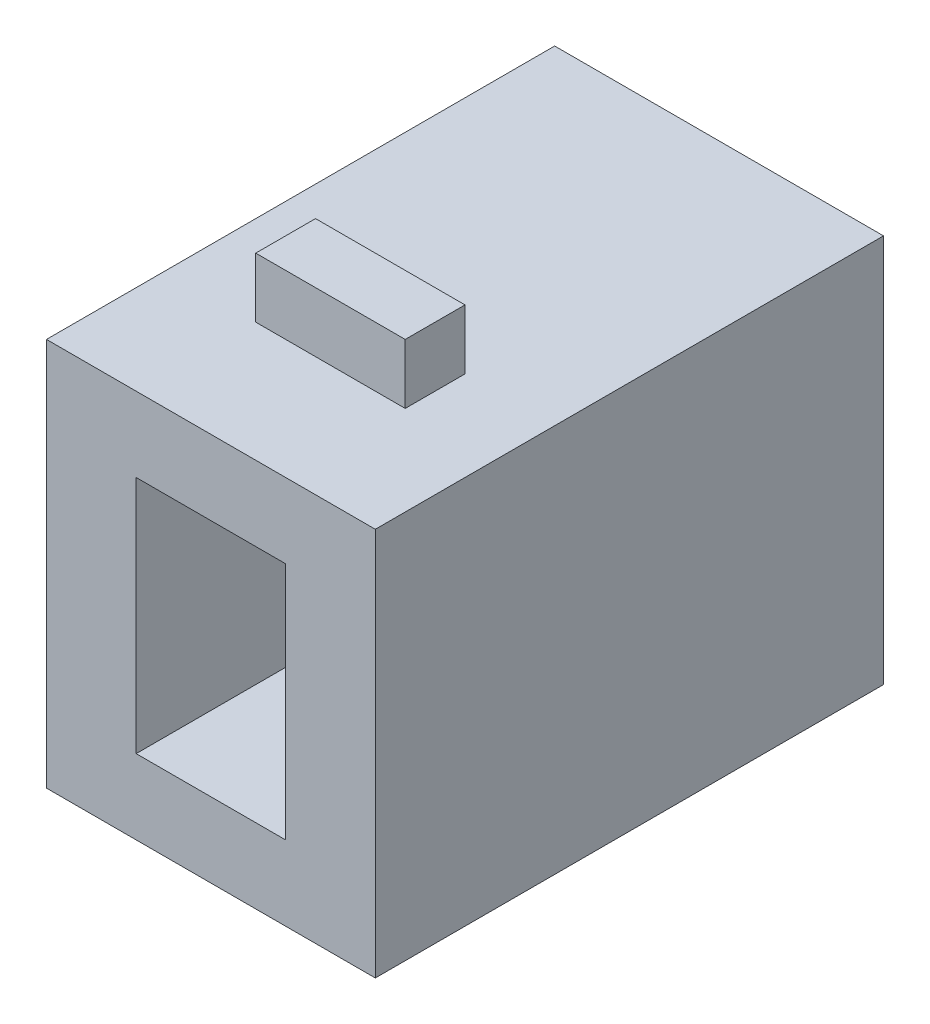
ISO-10303-21;
HEADER;
FILE_DESCRIPTION(('STEP AP214'),'2;1');
FILE_NAME('part.step','',(''),(''),'','','');
FILE_SCHEMA(('AUTOMOTIVE_DESIGN { 1 0 10303 214 1 1 1 1 }'));
ENDSEC;
DATA;
#1=APPLICATION_CONTEXT('core data for automotive mechanical design processes');
#2=APPLICATION_PROTOCOL_DEFINITION('international standard','automotive_design',2000,#1);
#3=PRODUCT_CONTEXT('',#1,'mechanical');
#4=PRODUCT('Part','Part','',(#3));
#5=PRODUCT_RELATED_PRODUCT_CATEGORY('part','',(#4));
#6=PRODUCT_DEFINITION_FORMATION('','',#4);
#7=PRODUCT_DEFINITION_CONTEXT('part definition',#1,'design');
#8=PRODUCT_DEFINITION('design','',#6,#7);
#9=PRODUCT_DEFINITION_SHAPE('','',#8);
#10=(LENGTH_UNIT() NAMED_UNIT(*) SI_UNIT(.MILLI.,.METRE.));
#11=(NAMED_UNIT(*) PLANE_ANGLE_UNIT() SI_UNIT($,.RADIAN.));
#12=(NAMED_UNIT(*) SI_UNIT($,.STERADIAN.) SOLID_ANGLE_UNIT());
#13=UNCERTAINTY_MEASURE_WITH_UNIT(LENGTH_MEASURE(1.E-05),#10,'distance_accuracy_value','');
#14=(GEOMETRIC_REPRESENTATION_CONTEXT(3) GLOBAL_UNCERTAINTY_ASSIGNED_CONTEXT((#13)) GLOBAL_UNIT_ASSIGNED_CONTEXT((#10,
#11,#12)) REPRESENTATION_CONTEXT('',''));
#15=CARTESIAN_POINT('',(0.,0.,0.));
#16=DIRECTION('',(0.,0.,1.));
#17=DIRECTION('',(1.,0.,0.));
#18=AXIS2_PLACEMENT_3D('',#15,#16,#17);
#19=CARTESIAN_POINT('',(-5.5,-6.49999999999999,15.));
#20=DIRECTION('',(0.,1.,0.));
#21=DIRECTION('',(0.,0.,1.));
#22=AXIS2_PLACEMENT_3D('',#19,#20,#21);
#23=PLANE('',#22);
#24=DIRECTION('',(0.,0.,-1.));
#25=VECTOR('',#24,1.);
#26=CARTESIAN_POINT('',(-5.5,-6.49999999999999,15.));
#27=LINE('',#26,#25);
#28=CARTESIAN_POINT('',(-5.5,-6.49999999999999,15.));
#29=VERTEX_POINT('',#28);
#30=CARTESIAN_POINT('',(-5.5,-6.50000000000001,-2.));
#31=VERTEX_POINT('',#30);
#32=EDGE_CURVE('E11',#29,#31,#27,.T.);
#33=ORIENTED_EDGE('',*,*,#32,.T.);
#34=DIRECTION('',(1.,0.,0.));
#35=VECTOR('',#34,1.);
#36=CARTESIAN_POINT('',(-5.5,-6.50000000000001,-2.));
#37=LINE('',#36,#35);
#38=CARTESIAN_POINT('',(5.5,-6.50000000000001,-2.));
#39=VERTEX_POINT('',#38);
#40=EDGE_CURVE('E239',#31,#39,#37,.T.);
#41=ORIENTED_EDGE('',*,*,#40,.T.);
#42=DIRECTION('',(0.,0.,-1.));
#43=VECTOR('',#42,1.);
#44=CARTESIAN_POINT('',(5.5,-6.49999999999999,15.));
#45=LINE('',#44,#43);
#46=CARTESIAN_POINT('',(5.5,-6.49999999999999,15.));
#47=VERTEX_POINT('',#46);
#48=EDGE_CURVE('E39',#47,#39,#45,.T.);
#49=ORIENTED_EDGE('',*,*,#48,.F.);
#50=DIRECTION('',(1.,0.,0.));
#51=VECTOR('',#50,1.);
#52=CARTESIAN_POINT('',(-5.5,-6.49999999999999,15.));
#53=LINE('',#52,#51);
#54=EDGE_CURVE('E251',#29,#47,#53,.T.);
#55=ORIENTED_EDGE('',*,*,#54,.F.);
#56=EDGE_LOOP('',(#33,#41,#49,#55));
#57=FACE_BOUND('',#56,.T.);
#58=DIRECTION('',(0.,0.,1.));
#59=VECTOR('',#58,1.);
#60=CARTESIAN_POINT('',(2.5,-6.49999999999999,11.));
#61=LINE('',#60,#59);
#62=CARTESIAN_POINT('',(2.5,-6.49999999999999,8.99999999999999));
#63=VERTEX_POINT('',#62);
#64=CARTESIAN_POINT('',(2.5,-6.49999999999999,11.));
#65=VERTEX_POINT('',#64);
#66=EDGE_CURVE('E139',#63,#65,#61,.T.);
#67=ORIENTED_EDGE('',*,*,#66,.F.);
#68=DIRECTION('',(1.,0.,0.));
#69=VECTOR('',#68,1.);
#70=CARTESIAN_POINT('',(2.5,-6.49999999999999,8.99999999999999));
#71=LINE('',#70,#69);
#72=CARTESIAN_POINT('',(-2.5,-6.49999999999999,9.));
#73=VERTEX_POINT('',#72);
#74=EDGE_CURVE('E141',#73,#63,#71,.T.);
#75=ORIENTED_EDGE('',*,*,#74,.F.);
#76=DIRECTION('',(0.,0.,-1.));
#77=VECTOR('',#76,1.);
#78=CARTESIAN_POINT('',(-2.5,-6.49999999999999,11.));
#79=LINE('',#78,#77);
#80=CARTESIAN_POINT('',(-2.5,-6.49999999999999,11.));
#81=VERTEX_POINT('',#80);
#82=EDGE_CURVE('E51',#81,#73,#79,.T.);
#83=ORIENTED_EDGE('',*,*,#82,.F.);
#84=DIRECTION('',(-1.,0.,0.));
#85=VECTOR('',#84,1.);
#86=CARTESIAN_POINT('',(2.5,-6.49999999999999,11.));
#87=LINE('',#86,#85);
#88=EDGE_CURVE('E46',#65,#81,#87,.T.);
#89=ORIENTED_EDGE('',*,*,#88,.F.);
#90=EDGE_LOOP('',(#67,#75,#83,#89));
#91=FACE_BOUND('',#90,.T.);
#92=ADVANCED_FACE('F31',(#57,#91),#23,.F.);
#93=CARTESIAN_POINT('',(-5.5,6.50000000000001,15.));
#94=DIRECTION('',(0.,-1.,0.));
#95=DIRECTION('',(0.,0.,-1.));
#96=AXIS2_PLACEMENT_3D('',#93,#94,#95);
#97=PLANE('',#96);
#98=DIRECTION('',(0.,0.,-1.));
#99=VECTOR('',#98,1.);
#100=CARTESIAN_POINT('',(5.5,6.50000000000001,15.));
#101=LINE('',#100,#99);
#102=CARTESIAN_POINT('',(5.5,6.50000000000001,15.));
#103=VERTEX_POINT('',#102);
#104=CARTESIAN_POINT('',(5.5,6.50000000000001,-2.));
#105=VERTEX_POINT('',#104);
#106=EDGE_CURVE('E259',#103,#105,#101,.T.);
#107=ORIENTED_EDGE('',*,*,#106,.T.);
#108=DIRECTION('',(-1.,0.,0.));
#109=VECTOR('',#108,1.);
#110=CARTESIAN_POINT('',(-5.5,6.50000000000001,-2.));
#111=LINE('',#110,#109);
#112=CARTESIAN_POINT('',(-5.5,6.50000000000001,-2.));
#113=VERTEX_POINT('',#112);
#114=EDGE_CURVE('E245',#105,#113,#111,.T.);
#115=ORIENTED_EDGE('',*,*,#114,.T.);
#116=DIRECTION('',(0.,0.,-1.));
#117=VECTOR('',#116,1.);
#118=CARTESIAN_POINT('',(-5.5,6.50000000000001,15.));
#119=LINE('',#118,#117);
#120=CARTESIAN_POINT('',(-5.5,6.50000000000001,15.));
#121=VERTEX_POINT('',#120);
#122=EDGE_CURVE('E257',#121,#113,#119,.T.);
#123=ORIENTED_EDGE('',*,*,#122,.F.);
#124=DIRECTION('',(-1.,0.,0.));
#125=VECTOR('',#124,1.);
#126=CARTESIAN_POINT('',(-5.5,6.50000000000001,15.));
#127=LINE('',#126,#125);
#128=EDGE_CURVE('E255',#103,#121,#127,.T.);
#129=ORIENTED_EDGE('',*,*,#128,.F.);
#130=EDGE_LOOP('',(#107,#115,#123,#129));
#131=FACE_BOUND('',#130,.T.);
#132=DIRECTION('',(0.,0.,-1.));
#133=VECTOR('',#132,1.);
#134=CARTESIAN_POINT('',(2.5,6.50000000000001,9.));
#135=LINE('',#134,#133);
#136=CARTESIAN_POINT('',(2.5,6.50000000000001,11.));
#137=VERTEX_POINT('',#136);
#138=CARTESIAN_POINT('',(2.5,6.50000000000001,9.));
#139=VERTEX_POINT('',#138);
#140=EDGE_CURVE('E171',#137,#139,#135,.T.);
#141=ORIENTED_EDGE('',*,*,#140,.F.);
#142=DIRECTION('',(1.,0.,0.));
#143=VECTOR('',#142,1.);
#144=CARTESIAN_POINT('',(2.5,6.50000000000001,11.));
#145=LINE('',#144,#143);
#146=CARTESIAN_POINT('',(-2.5,6.50000000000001,11.));
#147=VERTEX_POINT('',#146);
#148=EDGE_CURVE('E180',#147,#137,#145,.T.);
#149=ORIENTED_EDGE('',*,*,#148,.F.);
#150=DIRECTION('',(0.,0.,1.));
#151=VECTOR('',#150,1.);
#152=CARTESIAN_POINT('',(-2.5,6.50000000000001,9.));
#153=LINE('',#152,#151);
#154=CARTESIAN_POINT('',(-2.5,6.50000000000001,9.));
#155=VERTEX_POINT('',#154);
#156=EDGE_CURVE('E177',#155,#147,#153,.T.);
#157=ORIENTED_EDGE('',*,*,#156,.F.);
#158=DIRECTION('',(-1.,0.,0.));
#159=VECTOR('',#158,1.);
#160=CARTESIAN_POINT('',(2.5,6.50000000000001,9.));
#161=LINE('',#160,#159);
#162=EDGE_CURVE('E174',#139,#155,#161,.T.);
#163=ORIENTED_EDGE('',*,*,#162,.F.);
#164=EDGE_LOOP('',(#141,#149,#157,#163));
#165=FACE_BOUND('',#164,.T.);
#166=ADVANCED_FACE('F277',(#131,#165),#97,.F.);
#167=CARTESIAN_POINT('',(-5.5,-6.49999999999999,15.));
#168=DIRECTION('',(1.,0.,0.));
#169=DIRECTION('',(0.,0.,-1.));
#170=AXIS2_PLACEMENT_3D('',#167,#168,#169);
#171=PLANE('',#170);
#172=ORIENTED_EDGE('',*,*,#122,.T.);
#173=DIRECTION('',(0.,-1.,0.));
#174=VECTOR('',#173,1.);
#175=CARTESIAN_POINT('',(-5.5,-6.50000000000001,-2.));
#176=LINE('',#175,#174);
#177=EDGE_CURVE('E230',#113,#31,#176,.T.);
#178=ORIENTED_EDGE('',*,*,#177,.T.);
#179=ORIENTED_EDGE('',*,*,#32,.F.);
#180=DIRECTION('',(0.,-1.,0.));
#181=VECTOR('',#180,1.);
#182=CARTESIAN_POINT('',(-5.5,-6.49999999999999,15.));
#183=LINE('',#182,#181);
#184=EDGE_CURVE('E248',#121,#29,#183,.T.);
#185=ORIENTED_EDGE('',*,*,#184,.F.);
#186=EDGE_LOOP('',(#172,#178,#179,#185));
#187=FACE_BOUND('',#186,.T.);
#188=ADVANCED_FACE('F33',(#187),#171,.F.);
#189=CARTESIAN_POINT('',(5.5,-6.49999999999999,15.));
#190=DIRECTION('',(-1.,0.,0.));
#191=DIRECTION('',(0.,0.,1.));
#192=AXIS2_PLACEMENT_3D('',#189,#190,#191);
#193=PLANE('',#192);
#194=ORIENTED_EDGE('',*,*,#48,.T.);
#195=DIRECTION('',(0.,1.,0.));
#196=VECTOR('',#195,1.);
#197=CARTESIAN_POINT('',(5.5,-6.50000000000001,-2.));
#198=LINE('',#197,#196);
#199=EDGE_CURVE('E242',#39,#105,#198,.T.);
#200=ORIENTED_EDGE('',*,*,#199,.T.);
#201=ORIENTED_EDGE('',*,*,#106,.F.);
#202=DIRECTION('',(0.,1.,0.));
#203=VECTOR('',#202,1.);
#204=CARTESIAN_POINT('',(5.5,-6.49999999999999,15.));
#205=LINE('',#204,#203);
#206=EDGE_CURVE('E253',#47,#103,#205,.T.);
#207=ORIENTED_EDGE('',*,*,#206,.F.);
#208=EDGE_LOOP('',(#194,#200,#201,#207));
#209=FACE_BOUND('',#208,.T.);
#210=ADVANCED_FACE('F264',(#209),#193,.F.);
#211=CARTESIAN_POINT('',(-5.5,6.50000000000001,15.));
#212=DIRECTION('',(0.,0.,-1.));
#213=DIRECTION('',(-1.,0.,0.));
#214=AXIS2_PLACEMENT_3D('',#211,#212,#213);
#215=PLANE('',#214);
#216=DIRECTION('',(1.,0.,0.));
#217=VECTOR('',#216,1.);
#218=CARTESIAN_POINT('',(-2.5,-3.99999999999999,15.));
#219=LINE('',#218,#217);
#220=CARTESIAN_POINT('',(-2.5,-3.99999999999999,15.));
#221=VERTEX_POINT('',#220);
#222=CARTESIAN_POINT('',(2.5,-3.99999999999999,15.));
#223=VERTEX_POINT('',#222);
#224=EDGE_CURVE('E206',#221,#223,#219,.T.);
#225=ORIENTED_EDGE('',*,*,#224,.F.);
#226=DIRECTION('',(0.,-1.,0.));
#227=VECTOR('',#226,1.);
#228=CARTESIAN_POINT('',(-2.5,4.,15.));
#229=LINE('',#228,#227);
#230=CARTESIAN_POINT('',(-2.5,4.,15.));
#231=VERTEX_POINT('',#230);
#232=EDGE_CURVE('E204',#231,#221,#229,.T.);
#233=ORIENTED_EDGE('',*,*,#232,.F.);
#234=DIRECTION('',(-1.,0.,0.));
#235=VECTOR('',#234,1.);
#236=CARTESIAN_POINT('',(-2.5,4.,15.));
#237=LINE('',#236,#235);
#238=CARTESIAN_POINT('',(2.5,4.,15.));
#239=VERTEX_POINT('',#238);
#240=EDGE_CURVE('E212',#239,#231,#237,.T.);
#241=ORIENTED_EDGE('',*,*,#240,.F.);
#242=DIRECTION('',(0.,1.,0.));
#243=VECTOR('',#242,1.);
#244=CARTESIAN_POINT('',(2.5,4.,15.));
#245=LINE('',#244,#243);
#246=EDGE_CURVE('E209',#223,#239,#245,.T.);
#247=ORIENTED_EDGE('',*,*,#246,.F.);
#248=EDGE_LOOP('',(#225,#233,#241,#247));
#249=FACE_BOUND('',#248,.T.);
#250=ORIENTED_EDGE('',*,*,#184,.T.);
#251=ORIENTED_EDGE('',*,*,#54,.T.);
#252=ORIENTED_EDGE('',*,*,#206,.T.);
#253=ORIENTED_EDGE('',*,*,#128,.T.);
#254=EDGE_LOOP('',(#250,#251,#252,#253));
#255=FACE_BOUND('',#254,.T.);
#256=ADVANCED_FACE('F281',(#249,#255),#215,.F.);
#257=CARTESIAN_POINT('',(-5.5,6.50000000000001,-2.));
#258=DIRECTION('',(0.,0.,-1.));
#259=DIRECTION('',(-1.,0.,0.));
#260=AXIS2_PLACEMENT_3D('',#257,#258,#259);
#261=PLANE('',#260);
#262=ORIENTED_EDGE('',*,*,#177,.F.);
#263=ORIENTED_EDGE('',*,*,#114,.F.);
#264=ORIENTED_EDGE('',*,*,#199,.F.);
#265=ORIENTED_EDGE('',*,*,#40,.F.);
#266=EDGE_LOOP('',(#262,#263,#264,#265));
#267=FACE_BOUND('',#266,.T.);
#268=ADVANCED_FACE('F271',(#267),#261,.T.);
#269=CARTESIAN_POINT('',(-2.5,4.,0.));
#270=DIRECTION('',(-1.,0.,0.));
#271=DIRECTION('',(0.,0.,1.));
#272=AXIS2_PLACEMENT_3D('',#269,#270,#271);
#273=PLANE('',#272);
#274=ORIENTED_EDGE('',*,*,#232,.T.);
#275=DIRECTION('',(0.,0.,1.));
#276=VECTOR('',#275,1.);
#277=CARTESIAN_POINT('',(-2.5,-4.,0.));
#278=LINE('',#277,#276);
#279=CARTESIAN_POINT('',(-2.5,-4.,0.));
#280=VERTEX_POINT('',#279);
#281=EDGE_CURVE('E227',#280,#221,#278,.T.);
#282=ORIENTED_EDGE('',*,*,#281,.F.);
#283=DIRECTION('',(0.,-1.,0.));
#284=VECTOR('',#283,1.);
#285=CARTESIAN_POINT('',(-2.5,4.,0.));
#286=LINE('',#285,#284);
#287=CARTESIAN_POINT('',(-2.5,4.,0.));
#288=VERTEX_POINT('',#287);
#289=EDGE_CURVE('E215',#288,#280,#286,.T.);
#290=ORIENTED_EDGE('',*,*,#289,.F.);
#291=DIRECTION('',(0.,0.,1.));
#292=VECTOR('',#291,1.);
#293=CARTESIAN_POINT('',(-2.5,4.,0.));
#294=LINE('',#293,#292);
#295=EDGE_CURVE('E228',#288,#231,#294,.T.);
#296=ORIENTED_EDGE('',*,*,#295,.T.);
#297=EDGE_LOOP('',(#274,#282,#290,#296));
#298=FACE_BOUND('',#297,.T.);
#299=ADVANCED_FACE('F289',(#298),#273,.F.);
#300=CARTESIAN_POINT('',(-2.5,4.,0.));
#301=DIRECTION('',(0.,1.,0.));
#302=DIRECTION('',(0.,0.,1.));
#303=AXIS2_PLACEMENT_3D('',#300,#301,#302);
#304=PLANE('',#303);
#305=ORIENTED_EDGE('',*,*,#240,.T.);
#306=ORIENTED_EDGE('',*,*,#295,.F.);
#307=DIRECTION('',(-1.,0.,0.));
#308=VECTOR('',#307,1.);
#309=CARTESIAN_POINT('',(-2.5,4.,0.));
#310=LINE('',#309,#308);
#311=CARTESIAN_POINT('',(2.5,4.,0.));
#312=VERTEX_POINT('',#311);
#313=EDGE_CURVE('E224',#312,#288,#310,.T.);
#314=ORIENTED_EDGE('',*,*,#313,.F.);
#315=DIRECTION('',(0.,0.,1.));
#316=VECTOR('',#315,1.);
#317=CARTESIAN_POINT('',(2.5,4.,0.));
#318=LINE('',#317,#316);
#319=EDGE_CURVE('E231',#312,#239,#318,.T.);
#320=ORIENTED_EDGE('',*,*,#319,.T.);
#321=EDGE_LOOP('',(#305,#306,#314,#320));
#322=FACE_BOUND('',#321,.T.);
#323=ADVANCED_FACE('F326',(#322),#304,.F.);
#324=CARTESIAN_POINT('',(2.5,4.,0.));
#325=DIRECTION('',(1.,0.,0.));
#326=DIRECTION('',(0.,1.,0.));
#327=AXIS2_PLACEMENT_3D('',#324,#325,#326);
#328=PLANE('',#327);
#329=ORIENTED_EDGE('',*,*,#246,.T.);
#330=ORIENTED_EDGE('',*,*,#319,.F.);
#331=DIRECTION('',(0.,1.,0.));
#332=VECTOR('',#331,1.);
#333=CARTESIAN_POINT('',(2.5,4.,0.));
#334=LINE('',#333,#332);
#335=CARTESIAN_POINT('',(2.5,-4.,0.));
#336=VERTEX_POINT('',#335);
#337=EDGE_CURVE('E221',#336,#312,#334,.T.);
#338=ORIENTED_EDGE('',*,*,#337,.F.);
#339=DIRECTION('',(0.,0.,1.));
#340=VECTOR('',#339,1.);
#341=CARTESIAN_POINT('',(2.5,-4.,0.));
#342=LINE('',#341,#340);
#343=EDGE_CURVE('E233',#336,#223,#342,.T.);
#344=ORIENTED_EDGE('',*,*,#343,.T.);
#345=EDGE_LOOP('',(#329,#330,#338,#344));
#346=FACE_BOUND('',#345,.T.);
#347=ADVANCED_FACE('F336',(#346),#328,.F.);
#348=CARTESIAN_POINT('',(-2.5,-4.,0.));
#349=DIRECTION('',(0.,-1.,0.));
#350=DIRECTION('',(0.,0.,-1.));
#351=AXIS2_PLACEMENT_3D('',#348,#349,#350);
#352=PLANE('',#351);
#353=ORIENTED_EDGE('',*,*,#224,.T.);
#354=ORIENTED_EDGE('',*,*,#343,.F.);
#355=DIRECTION('',(1.,0.,0.));
#356=VECTOR('',#355,1.);
#357=CARTESIAN_POINT('',(-2.5,-4.,0.));
#358=LINE('',#357,#356);
#359=EDGE_CURVE('E218',#280,#336,#358,.T.);
#360=ORIENTED_EDGE('',*,*,#359,.F.);
#361=ORIENTED_EDGE('',*,*,#281,.T.);
#362=EDGE_LOOP('',(#353,#354,#360,#361));
#363=FACE_BOUND('',#362,.T.);
#364=ADVANCED_FACE('F346',(#363),#352,.F.);
#365=CARTESIAN_POINT('',(-2.5,-4.,0.));
#366=DIRECTION('',(0.,0.,1.));
#367=DIRECTION('',(1.,0.,0.));
#368=AXIS2_PLACEMENT_3D('',#365,#366,#367);
#369=PLANE('',#368);
#370=ORIENTED_EDGE('',*,*,#289,.T.);
#371=ORIENTED_EDGE('',*,*,#359,.T.);
#372=ORIENTED_EDGE('',*,*,#337,.T.);
#373=ORIENTED_EDGE('',*,*,#313,.T.);
#374=EDGE_LOOP('',(#370,#371,#372,#373));
#375=FACE_BOUND('',#374,.T.);
#376=ADVANCED_FACE('F356',(#375),#369,.T.);
#377=CARTESIAN_POINT('',(2.5,8.50000000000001,9.));
#378=DIRECTION('',(-1.,0.,0.));
#379=DIRECTION('',(0.,0.,1.));
#380=AXIS2_PLACEMENT_3D('',#377,#378,#379);
#381=PLANE('',#380);
#382=ORIENTED_EDGE('',*,*,#140,.T.);
#383=DIRECTION('',(0.,-1.,0.));
#384=VECTOR('',#383,1.);
#385=CARTESIAN_POINT('',(2.5,8.50000000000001,9.));
#386=LINE('',#385,#384);
#387=CARTESIAN_POINT('',(2.5,8.50000000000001,9.));
#388=VERTEX_POINT('',#387);
#389=EDGE_CURVE('E201',#388,#139,#386,.T.);
#390=ORIENTED_EDGE('',*,*,#389,.F.);
#391=DIRECTION('',(0.,0.,-1.));
#392=VECTOR('',#391,1.);
#393=CARTESIAN_POINT('',(2.5,8.50000000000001,9.));
#394=LINE('',#393,#392);
#395=CARTESIAN_POINT('',(2.5,8.50000000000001,11.));
#396=VERTEX_POINT('',#395);
#397=EDGE_CURVE('E183',#396,#388,#394,.T.);
#398=ORIENTED_EDGE('',*,*,#397,.F.);
#399=DIRECTION('',(0.,-1.,0.));
#400=VECTOR('',#399,1.);
#401=CARTESIAN_POINT('',(2.5,8.50000000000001,11.));
#402=LINE('',#401,#400);
#403=EDGE_CURVE('E192',#396,#137,#402,.T.);
#404=ORIENTED_EDGE('',*,*,#403,.T.);
#405=EDGE_LOOP('',(#382,#390,#398,#404));
#406=FACE_BOUND('',#405,.T.);
#407=ADVANCED_FACE('F366',(#406),#381,.F.);
#408=CARTESIAN_POINT('',(2.5,8.50000000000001,9.));
#409=DIRECTION('',(0.,0.,1.));
#410=DIRECTION('',(1.,0.,0.));
#411=AXIS2_PLACEMENT_3D('',#408,#409,#410);
#412=PLANE('',#411);
#413=ORIENTED_EDGE('',*,*,#162,.T.);
#414=DIRECTION('',(0.,-1.,0.));
#415=VECTOR('',#414,1.);
#416=CARTESIAN_POINT('',(-2.5,8.50000000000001,9.));
#417=LINE('',#416,#415);
#418=CARTESIAN_POINT('',(-2.5,8.50000000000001,9.));
#419=VERTEX_POINT('',#418);
#420=EDGE_CURVE('E198',#419,#155,#417,.T.);
#421=ORIENTED_EDGE('',*,*,#420,.F.);
#422=DIRECTION('',(-1.,0.,0.));
#423=VECTOR('',#422,1.);
#424=CARTESIAN_POINT('',(2.5,8.50000000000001,9.));
#425=LINE('',#424,#423);
#426=EDGE_CURVE('E186',#388,#419,#425,.T.);
#427=ORIENTED_EDGE('',*,*,#426,.F.);
#428=ORIENTED_EDGE('',*,*,#389,.T.);
#429=EDGE_LOOP('',(#413,#421,#427,#428));
#430=FACE_BOUND('',#429,.T.);
#431=ADVANCED_FACE('F377',(#430),#412,.F.);
#432=CARTESIAN_POINT('',(-2.5,8.50000000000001,9.));
#433=DIRECTION('',(1.,0.,0.));
#434=DIRECTION('',(0.,0.,-1.));
#435=AXIS2_PLACEMENT_3D('',#432,#433,#434);
#436=PLANE('',#435);
#437=ORIENTED_EDGE('',*,*,#156,.T.);
#438=DIRECTION('',(0.,-1.,0.));
#439=VECTOR('',#438,1.);
#440=CARTESIAN_POINT('',(-2.5,8.50000000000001,11.));
#441=LINE('',#440,#439);
#442=CARTESIAN_POINT('',(-2.5,8.50000000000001,11.));
#443=VERTEX_POINT('',#442);
#444=EDGE_CURVE('E195',#443,#147,#441,.T.);
#445=ORIENTED_EDGE('',*,*,#444,.F.);
#446=DIRECTION('',(0.,0.,1.));
#447=VECTOR('',#446,1.);
#448=CARTESIAN_POINT('',(-2.5,8.50000000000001,9.));
#449=LINE('',#448,#447);
#450=EDGE_CURVE('E188',#419,#443,#449,.T.);
#451=ORIENTED_EDGE('',*,*,#450,.F.);
#452=ORIENTED_EDGE('',*,*,#420,.T.);
#453=EDGE_LOOP('',(#437,#445,#451,#452));
#454=FACE_BOUND('',#453,.T.);
#455=ADVANCED_FACE('F387',(#454),#436,.F.);
#456=CARTESIAN_POINT('',(2.5,8.50000000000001,11.));
#457=DIRECTION('',(0.,0.,-1.));
#458=DIRECTION('',(-1.,0.,0.));
#459=AXIS2_PLACEMENT_3D('',#456,#457,#458);
#460=PLANE('',#459);
#461=ORIENTED_EDGE('',*,*,#148,.T.);
#462=ORIENTED_EDGE('',*,*,#403,.F.);
#463=DIRECTION('',(1.,0.,0.));
#464=VECTOR('',#463,1.);
#465=CARTESIAN_POINT('',(2.5,8.50000000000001,11.));
#466=LINE('',#465,#464);
#467=EDGE_CURVE('E190',#443,#396,#466,.T.);
#468=ORIENTED_EDGE('',*,*,#467,.F.);
#469=ORIENTED_EDGE('',*,*,#444,.T.);
#470=EDGE_LOOP('',(#461,#462,#468,#469));
#471=FACE_BOUND('',#470,.T.);
#472=ADVANCED_FACE('F397',(#471),#460,.F.);
#473=CARTESIAN_POINT('',(2.5,8.50000000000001,11.));
#474=DIRECTION('',(0.,-1.,0.));
#475=DIRECTION('',(0.,0.,-1.));
#476=AXIS2_PLACEMENT_3D('',#473,#474,#475);
#477=PLANE('',#476);
#478=ORIENTED_EDGE('',*,*,#397,.T.);
#479=ORIENTED_EDGE('',*,*,#426,.T.);
#480=ORIENTED_EDGE('',*,*,#450,.T.);
#481=ORIENTED_EDGE('',*,*,#467,.T.);
#482=EDGE_LOOP('',(#478,#479,#480,#481));
#483=FACE_BOUND('',#482,.T.);
#484=ADVANCED_FACE('F407',(#483),#477,.F.);
#485=CARTESIAN_POINT('',(2.5,-8.49999999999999,11.));
#486=DIRECTION('',(-1.,0.,0.));
#487=DIRECTION('',(0.,0.,1.));
#488=AXIS2_PLACEMENT_3D('',#485,#486,#487);
#489=PLANE('',#488);
#490=ORIENTED_EDGE('',*,*,#66,.T.);
#491=DIRECTION('',(0.,1.,0.));
#492=VECTOR('',#491,1.);
#493=CARTESIAN_POINT('',(2.5,-8.49999999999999,11.));
#494=LINE('',#493,#492);
#495=CARTESIAN_POINT('',(2.5,-8.49999999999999,11.));
#496=VERTEX_POINT('',#495);
#497=EDGE_CURVE('E169',#496,#65,#494,.T.);
#498=ORIENTED_EDGE('',*,*,#497,.F.);
#499=DIRECTION('',(0.,0.,1.));
#500=VECTOR('',#499,1.);
#501=CARTESIAN_POINT('',(2.5,-8.49999999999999,11.));
#502=LINE('',#501,#500);
#503=CARTESIAN_POINT('',(2.5,-8.49999999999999,8.99999999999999));
#504=VERTEX_POINT('',#503);
#505=EDGE_CURVE('E155',#504,#496,#502,.T.);
#506=ORIENTED_EDGE('',*,*,#505,.F.);
#507=DIRECTION('',(0.,1.,0.));
#508=VECTOR('',#507,1.);
#509=CARTESIAN_POINT('',(2.5,-8.49999999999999,8.99999999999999));
#510=LINE('',#509,#508);
#511=EDGE_CURVE('E151',#504,#63,#510,.T.);
#512=ORIENTED_EDGE('',*,*,#511,.T.);
#513=EDGE_LOOP('',(#490,#498,#506,#512));
#514=FACE_BOUND('',#513,.T.);
#515=ADVANCED_FACE('F157',(#514),#489,.F.);
#516=CARTESIAN_POINT('',(2.5,-8.49999999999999,11.));
#517=DIRECTION('',(0.,0.,-1.));
#518=DIRECTION('',(-1.,0.,0.));
#519=AXIS2_PLACEMENT_3D('',#516,#517,#518);
#520=PLANE('',#519);
#521=ORIENTED_EDGE('',*,*,#88,.T.);
#522=DIRECTION('',(0.,1.,0.));
#523=VECTOR('',#522,1.);
#524=CARTESIAN_POINT('',(-2.5,-8.49999999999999,11.));
#525=LINE('',#524,#523);
#526=CARTESIAN_POINT('',(-2.5,-8.49999999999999,11.));
#527=VERTEX_POINT('',#526);
#528=EDGE_CURVE('E161',#527,#81,#525,.T.);
#529=ORIENTED_EDGE('',*,*,#528,.F.);
#530=DIRECTION('',(-1.,0.,0.));
#531=VECTOR('',#530,1.);
#532=CARTESIAN_POINT('',(2.5,-8.49999999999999,11.));
#533=LINE('',#532,#531);
#534=EDGE_CURVE('E468',#496,#527,#533,.T.);
#535=ORIENTED_EDGE('',*,*,#534,.F.);
#536=ORIENTED_EDGE('',*,*,#497,.T.);
#537=EDGE_LOOP('',(#521,#529,#535,#536));
#538=FACE_BOUND('',#537,.T.);
#539=ADVANCED_FACE('F427',(#538),#520,.F.);
#540=CARTESIAN_POINT('',(-2.5,-8.49999999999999,11.));
#541=DIRECTION('',(1.,0.,0.));
#542=DIRECTION('',(0.,0.,-1.));
#543=AXIS2_PLACEMENT_3D('',#540,#541,#542);
#544=PLANE('',#543);
#545=ORIENTED_EDGE('',*,*,#82,.T.);
#546=DIRECTION('',(0.,1.,0.));
#547=VECTOR('',#546,1.);
#548=CARTESIAN_POINT('',(-2.5,-8.49999999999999,9.));
#549=LINE('',#548,#547);
#550=CARTESIAN_POINT('',(-2.5,-8.49999999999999,9.));
#551=VERTEX_POINT('',#550);
#552=EDGE_CURVE('E154',#551,#73,#549,.T.);
#553=ORIENTED_EDGE('',*,*,#552,.F.);
#554=DIRECTION('',(0.,0.,-1.));
#555=VECTOR('',#554,1.);
#556=CARTESIAN_POINT('',(-2.5,-8.49999999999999,11.));
#557=LINE('',#556,#555);
#558=EDGE_CURVE('E163',#527,#551,#557,.T.);
#559=ORIENTED_EDGE('',*,*,#558,.F.);
#560=ORIENTED_EDGE('',*,*,#528,.T.);
#561=EDGE_LOOP('',(#545,#553,#559,#560));
#562=FACE_BOUND('',#561,.T.);
#563=ADVANCED_FACE('F436',(#562),#544,.F.);
#564=CARTESIAN_POINT('',(2.5,-8.49999999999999,8.99999999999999));
#565=DIRECTION('',(0.,0.,1.));
#566=DIRECTION('',(1.,0.,0.));
#567=AXIS2_PLACEMENT_3D('',#564,#565,#566);
#568=PLANE('',#567);
#569=ORIENTED_EDGE('',*,*,#74,.T.);
#570=ORIENTED_EDGE('',*,*,#511,.F.);
#571=DIRECTION('',(1.,0.,0.));
#572=VECTOR('',#571,1.);
#573=CARTESIAN_POINT('',(2.5,-8.49999999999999,8.99999999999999));
#574=LINE('',#573,#572);
#575=EDGE_CURVE('E159',#551,#504,#574,.T.);
#576=ORIENTED_EDGE('',*,*,#575,.F.);
#577=ORIENTED_EDGE('',*,*,#552,.T.);
#578=EDGE_LOOP('',(#569,#570,#576,#577));
#579=FACE_BOUND('',#578,.T.);
#580=ADVANCED_FACE('F149',(#579),#568,.F.);
#581=CARTESIAN_POINT('',(2.5,-8.49999999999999,11.));
#582=DIRECTION('',(0.,1.,0.));
#583=DIRECTION('',(0.,0.,1.));
#584=AXIS2_PLACEMENT_3D('',#581,#582,#583);
#585=PLANE('',#584);
#586=ORIENTED_EDGE('',*,*,#505,.T.);
#587=ORIENTED_EDGE('',*,*,#534,.T.);
#588=ORIENTED_EDGE('',*,*,#558,.T.);
#589=ORIENTED_EDGE('',*,*,#575,.T.);
#590=EDGE_LOOP('',(#586,#587,#588,#589));
#591=FACE_BOUND('',#590,.T.);
#592=ADVANCED_FACE('F455',(#591),#585,.F.);
#593=CLOSED_SHELL('',(#92,#166,#188,#210,#256,#268,#299,#323,#347,#364,#376,#407,#431,#455,#472,
#484,#515,#539,#563,#580,#592));
#594=MANIFOLD_SOLID_BREP('B2',#593);
#595=ADVANCED_BREP_SHAPE_REPRESENTATION('',(#18,#594),#14);
#596=SHAPE_DEFINITION_REPRESENTATION(#9,#595);
ENDSEC;
END-ISO-10303-21;
